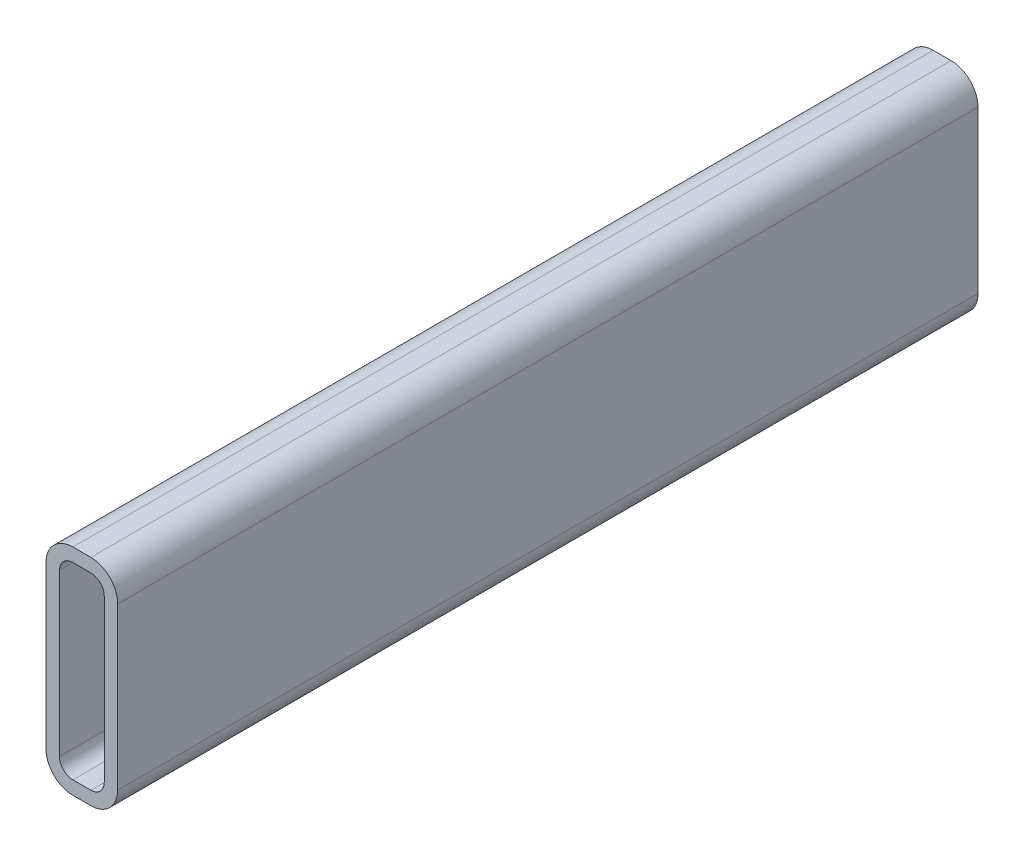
ISO-10303-21;
HEADER;
FILE_DESCRIPTION(('STEP AP214'),'2;1');
FILE_NAME('part.step','',(''),(''),'','','');
FILE_SCHEMA(('AUTOMOTIVE_DESIGN { 1 0 10303 214 1 1 1 1 }'));
ENDSEC;
DATA;
#1=APPLICATION_CONTEXT('core data for automotive mechanical design processes');
#2=APPLICATION_PROTOCOL_DEFINITION('international standard','automotive_design',2000,#1);
#3=PRODUCT_CONTEXT('',#1,'mechanical');
#4=PRODUCT('Part','Part','',(#3));
#5=PRODUCT_RELATED_PRODUCT_CATEGORY('part','',(#4));
#6=PRODUCT_DEFINITION_FORMATION('','',#4);
#7=PRODUCT_DEFINITION_CONTEXT('part definition',#1,'design');
#8=PRODUCT_DEFINITION('design','',#6,#7);
#9=PRODUCT_DEFINITION_SHAPE('','',#8);
#10=(LENGTH_UNIT() NAMED_UNIT(*) SI_UNIT(.MILLI.,.METRE.));
#11=(NAMED_UNIT(*) PLANE_ANGLE_UNIT() SI_UNIT($,.RADIAN.));
#12=(NAMED_UNIT(*) SI_UNIT($,.STERADIAN.) SOLID_ANGLE_UNIT());
#13=UNCERTAINTY_MEASURE_WITH_UNIT(LENGTH_MEASURE(1.E-05),#10,'distance_accuracy_value','');
#14=(GEOMETRIC_REPRESENTATION_CONTEXT(3) GLOBAL_UNCERTAINTY_ASSIGNED_CONTEXT((#13)) GLOBAL_UNIT_ASSIGNED_CONTEXT((#10,
#11,#12)) REPRESENTATION_CONTEXT('',''));
#15=CARTESIAN_POINT('',(0.,0.,0.));
#16=DIRECTION('',(0.,0.,1.));
#17=DIRECTION('',(1.,0.,0.));
#18=AXIS2_PLACEMENT_3D('',#15,#16,#17);
#19=CARTESIAN_POINT('',(9.525,66.675,304.8));
#20=DIRECTION('',(0.,0.,1.));
#21=DIRECTION('',(1.,0.,0.));
#22=AXIS2_PLACEMENT_3D('',#19,#20,#21);
#23=PLANE('',#22);
#24=CARTESIAN_POINT('',(9.525,66.675,304.8));
#25=DIRECTION('',(0.,0.,1.));
#26=DIRECTION('',(1.,0.,0.));
#27=AXIS2_PLACEMENT_3D('',#24,#25,#26);
#28=CIRCLE('',#27,9.52500000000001);
#29=CARTESIAN_POINT('',(9.525,76.2,304.8));
#30=VERTEX_POINT('',#29);
#31=CARTESIAN_POINT('',(0.,66.675,304.8));
#32=VERTEX_POINT('',#31);
#33=EDGE_CURVE('E211',#30,#32,#28,.T.);
#34=ORIENTED_EDGE('',*,*,#33,.T.);
#35=DIRECTION('',(0.,-1.,0.));
#36=VECTOR('',#35,1.);
#37=CARTESIAN_POINT('',(0.,9.525,304.8));
#38=LINE('',#37,#36);
#39=CARTESIAN_POINT('',(0.,9.525,304.8));
#40=VERTEX_POINT('',#39);
#41=EDGE_CURVE('E214',#32,#40,#38,.T.);
#42=ORIENTED_EDGE('',*,*,#41,.T.);
#43=CARTESIAN_POINT('',(9.525,9.525,304.8));
#44=DIRECTION('',(0.,0.,1.));
#45=DIRECTION('',(1.,0.,0.));
#46=AXIS2_PLACEMENT_3D('',#43,#44,#45);
#47=CIRCLE('',#46,9.525);
#48=CARTESIAN_POINT('',(9.525,0.,304.8));
#49=VERTEX_POINT('',#48);
#50=EDGE_CURVE('E217',#40,#49,#47,.T.);
#51=ORIENTED_EDGE('',*,*,#50,.T.);
#52=DIRECTION('',(1.,0.,0.));
#53=VECTOR('',#52,1.);
#54=CARTESIAN_POINT('',(15.875,0.,304.8));
#55=LINE('',#54,#53);
#56=CARTESIAN_POINT('',(15.875,0.,304.8));
#57=VERTEX_POINT('',#56);
#58=EDGE_CURVE('E219',#49,#57,#55,.T.);
#59=ORIENTED_EDGE('',*,*,#58,.T.);
#60=CARTESIAN_POINT('',(15.875,9.525,304.8));
#61=DIRECTION('',(0.,0.,1.));
#62=DIRECTION('',(1.,0.,0.));
#63=AXIS2_PLACEMENT_3D('',#60,#61,#62);
#64=CIRCLE('',#63,9.525);
#65=CARTESIAN_POINT('',(25.4,9.525,304.8));
#66=VERTEX_POINT('',#65);
#67=EDGE_CURVE('E221',#57,#66,#64,.T.);
#68=ORIENTED_EDGE('',*,*,#67,.T.);
#69=DIRECTION('',(0.,1.,0.));
#70=VECTOR('',#69,1.);
#71=CARTESIAN_POINT('',(25.4,66.675,304.8));
#72=LINE('',#71,#70);
#73=CARTESIAN_POINT('',(25.4,66.675,304.8));
#74=VERTEX_POINT('',#73);
#75=EDGE_CURVE('E223',#66,#74,#72,.T.);
#76=ORIENTED_EDGE('',*,*,#75,.T.);
#77=CARTESIAN_POINT('',(15.875,66.675,304.8));
#78=DIRECTION('',(0.,0.,1.));
#79=DIRECTION('',(1.,0.,0.));
#80=AXIS2_PLACEMENT_3D('',#77,#78,#79);
#81=CIRCLE('',#80,9.52500000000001);
#82=CARTESIAN_POINT('',(15.875,76.2,304.8));
#83=VERTEX_POINT('',#82);
#84=EDGE_CURVE('E225',#74,#83,#81,.T.);
#85=ORIENTED_EDGE('',*,*,#84,.T.);
#86=DIRECTION('',(-1.,0.,0.));
#87=VECTOR('',#86,1.);
#88=CARTESIAN_POINT('',(9.525,76.2,304.8));
#89=LINE('',#88,#87);
#90=EDGE_CURVE('E227',#83,#30,#89,.T.);
#91=ORIENTED_EDGE('',*,*,#90,.T.);
#92=EDGE_LOOP('',(#34,#42,#51,#59,#68,#76,#85,#91));
#93=FACE_BOUND('',#92,.T.);
#94=DIRECTION('',(0.,-1.,0.));
#95=VECTOR('',#94,1.);
#96=CARTESIAN_POINT('',(4.7625,9.525,304.8));
#97=LINE('',#96,#95);
#98=CARTESIAN_POINT('',(4.7625,66.675,304.8));
#99=VERTEX_POINT('',#98);
#100=CARTESIAN_POINT('',(4.7625,9.525,304.8));
#101=VERTEX_POINT('',#100);
#102=EDGE_CURVE('E154',#99,#101,#97,.T.);
#103=ORIENTED_EDGE('',*,*,#102,.F.);
#104=CARTESIAN_POINT('',(9.525,66.675,304.8));
#105=DIRECTION('',(0.,0.,1.));
#106=DIRECTION('',(1.,0.,0.));
#107=AXIS2_PLACEMENT_3D('',#104,#105,#106);
#108=CIRCLE('',#107,4.7625);
#109=CARTESIAN_POINT('',(9.525,71.4375,304.8));
#110=VERTEX_POINT('',#109);
#111=EDGE_CURVE('E146',#110,#99,#108,.T.);
#112=ORIENTED_EDGE('',*,*,#111,.F.);
#113=DIRECTION('',(-1.,0.,0.));
#114=VECTOR('',#113,1.);
#115=CARTESIAN_POINT('',(9.525,71.4375,304.8));
#116=LINE('',#115,#114);
#117=CARTESIAN_POINT('',(15.875,71.4375,304.8));
#118=VERTEX_POINT('',#117);
#119=EDGE_CURVE('E179',#118,#110,#116,.T.);
#120=ORIENTED_EDGE('',*,*,#119,.F.);
#121=CARTESIAN_POINT('',(15.875,66.675,304.8));
#122=DIRECTION('',(0.,0.,1.));
#123=DIRECTION('',(1.,0.,0.));
#124=AXIS2_PLACEMENT_3D('',#121,#122,#123);
#125=CIRCLE('',#124,4.7625);
#126=CARTESIAN_POINT('',(20.6375,66.675,304.8));
#127=VERTEX_POINT('',#126);
#128=EDGE_CURVE('E177',#127,#118,#125,.T.);
#129=ORIENTED_EDGE('',*,*,#128,.F.);
#130=DIRECTION('',(0.,1.,0.));
#131=VECTOR('',#130,1.);
#132=CARTESIAN_POINT('',(20.6375,66.675,304.8));
#133=LINE('',#132,#131);
#134=CARTESIAN_POINT('',(20.6375,9.525,304.8));
#135=VERTEX_POINT('',#134);
#136=EDGE_CURVE('E175',#135,#127,#133,.T.);
#137=ORIENTED_EDGE('',*,*,#136,.F.);
#138=CARTESIAN_POINT('',(15.875,9.525,304.8));
#139=DIRECTION('',(0.,0.,1.));
#140=DIRECTION('',(1.,0.,0.));
#141=AXIS2_PLACEMENT_3D('',#138,#139,#140);
#142=CIRCLE('',#141,4.7625);
#143=CARTESIAN_POINT('',(15.875,4.7625,304.8));
#144=VERTEX_POINT('',#143);
#145=EDGE_CURVE('E173',#144,#135,#142,.T.);
#146=ORIENTED_EDGE('',*,*,#145,.F.);
#147=DIRECTION('',(1.,0.,0.));
#148=VECTOR('',#147,1.);
#149=CARTESIAN_POINT('',(15.875,4.7625,304.8));
#150=LINE('',#149,#148);
#151=CARTESIAN_POINT('',(9.525,4.7625,304.8));
#152=VERTEX_POINT('',#151);
#153=EDGE_CURVE('E169',#152,#144,#150,.T.);
#154=ORIENTED_EDGE('',*,*,#153,.F.);
#155=CARTESIAN_POINT('',(9.525,9.525,304.8));
#156=DIRECTION('',(0.,0.,1.));
#157=DIRECTION('',(1.,0.,0.));
#158=AXIS2_PLACEMENT_3D('',#155,#156,#157);
#159=CIRCLE('',#158,4.7625);
#160=EDGE_CURVE('E167',#101,#152,#159,.T.);
#161=ORIENTED_EDGE('',*,*,#160,.F.);
#162=EDGE_LOOP('',(#103,#112,#120,#129,#137,#146,#154,#161));
#163=FACE_BOUND('',#162,.T.);
#164=ADVANCED_FACE('F33',(#93,#163),#23,.T.);
#165=CARTESIAN_POINT('',(9.525,66.675,0.));
#166=DIRECTION('',(0.,0.,1.));
#167=DIRECTION('',(1.,0.,0.));
#168=AXIS2_PLACEMENT_3D('',#165,#166,#167);
#169=PLANE('',#168);
#170=CARTESIAN_POINT('',(9.525,66.675,0.));
#171=DIRECTION('',(0.,0.,1.));
#172=DIRECTION('',(1.,0.,0.));
#173=AXIS2_PLACEMENT_3D('',#170,#171,#172);
#174=CIRCLE('',#173,9.52500000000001);
#175=CARTESIAN_POINT('',(9.525,76.2,0.));
#176=VERTEX_POINT('',#175);
#177=CARTESIAN_POINT('',(0.,66.675,0.));
#178=VERTEX_POINT('',#177);
#179=EDGE_CURVE('E162',#176,#178,#174,.T.);
#180=ORIENTED_EDGE('',*,*,#179,.F.);
#181=DIRECTION('',(-1.,0.,0.));
#182=VECTOR('',#181,1.);
#183=CARTESIAN_POINT('',(9.525,76.2,0.));
#184=LINE('',#183,#182);
#185=CARTESIAN_POINT('',(15.875,76.2,0.));
#186=VERTEX_POINT('',#185);
#187=EDGE_CURVE('E215',#186,#176,#184,.T.);
#188=ORIENTED_EDGE('',*,*,#187,.F.);
#189=CARTESIAN_POINT('',(15.875,66.675,0.));
#190=DIRECTION('',(0.,0.,1.));
#191=DIRECTION('',(1.,0.,0.));
#192=AXIS2_PLACEMENT_3D('',#189,#190,#191);
#193=CIRCLE('',#192,9.52500000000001);
#194=CARTESIAN_POINT('',(25.4,66.675,0.));
#195=VERTEX_POINT('',#194);
#196=EDGE_CURVE('E242',#195,#186,#193,.T.);
#197=ORIENTED_EDGE('',*,*,#196,.F.);
#198=DIRECTION('',(0.,1.,0.));
#199=VECTOR('',#198,1.);
#200=CARTESIAN_POINT('',(25.4,66.675,0.));
#201=LINE('',#200,#199);
#202=CARTESIAN_POINT('',(25.4,9.525,0.));
#203=VERTEX_POINT('',#202);
#204=EDGE_CURVE('E240',#203,#195,#201,.T.);
#205=ORIENTED_EDGE('',*,*,#204,.F.);
#206=CARTESIAN_POINT('',(15.875,9.525,0.));
#207=DIRECTION('',(0.,0.,1.));
#208=DIRECTION('',(1.,0.,0.));
#209=AXIS2_PLACEMENT_3D('',#206,#207,#208);
#210=CIRCLE('',#209,9.525);
#211=CARTESIAN_POINT('',(15.875,0.,0.));
#212=VERTEX_POINT('',#211);
#213=EDGE_CURVE('E238',#212,#203,#210,.T.);
#214=ORIENTED_EDGE('',*,*,#213,.F.);
#215=DIRECTION('',(1.,0.,0.));
#216=VECTOR('',#215,1.);
#217=CARTESIAN_POINT('',(15.875,0.,0.));
#218=LINE('',#217,#216);
#219=CARTESIAN_POINT('',(9.525,0.,0.));
#220=VERTEX_POINT('',#219);
#221=EDGE_CURVE('E236',#220,#212,#218,.T.);
#222=ORIENTED_EDGE('',*,*,#221,.F.);
#223=CARTESIAN_POINT('',(9.525,9.525,0.));
#224=DIRECTION('',(0.,0.,1.));
#225=DIRECTION('',(1.,0.,0.));
#226=AXIS2_PLACEMENT_3D('',#223,#224,#225);
#227=CIRCLE('',#226,9.525);
#228=CARTESIAN_POINT('',(0.,9.525,0.));
#229=VERTEX_POINT('',#228);
#230=EDGE_CURVE('E234',#229,#220,#227,.T.);
#231=ORIENTED_EDGE('',*,*,#230,.F.);
#232=DIRECTION('',(0.,-1.,0.));
#233=VECTOR('',#232,1.);
#234=CARTESIAN_POINT('',(0.,9.525,0.));
#235=LINE('',#234,#233);
#236=EDGE_CURVE('E232',#178,#229,#235,.T.);
#237=ORIENTED_EDGE('',*,*,#236,.F.);
#238=EDGE_LOOP('',(#180,#188,#197,#205,#214,#222,#231,#237));
#239=FACE_BOUND('',#238,.T.);
#240=CARTESIAN_POINT('',(9.525,66.675,0.));
#241=DIRECTION('',(0.,0.,1.));
#242=DIRECTION('',(1.,0.,0.));
#243=AXIS2_PLACEMENT_3D('',#240,#241,#242);
#244=CIRCLE('',#243,4.7625);
#245=CARTESIAN_POINT('',(9.525,71.4375,0.));
#246=VERTEX_POINT('',#245);
#247=CARTESIAN_POINT('',(4.7625,66.675,0.));
#248=VERTEX_POINT('',#247);
#249=EDGE_CURVE('E56',#246,#248,#244,.T.);
#250=ORIENTED_EDGE('',*,*,#249,.T.);
#251=DIRECTION('',(0.,-1.,0.));
#252=VECTOR('',#251,1.);
#253=CARTESIAN_POINT('',(4.7625,9.525,0.));
#254=LINE('',#253,#252);
#255=CARTESIAN_POINT('',(4.7625,9.525,0.));
#256=VERTEX_POINT('',#255);
#257=EDGE_CURVE('E161',#248,#256,#254,.T.);
#258=ORIENTED_EDGE('',*,*,#257,.T.);
#259=CARTESIAN_POINT('',(9.525,9.525,0.));
#260=DIRECTION('',(0.,0.,1.));
#261=DIRECTION('',(1.,0.,0.));
#262=AXIS2_PLACEMENT_3D('',#259,#260,#261);
#263=CIRCLE('',#262,4.7625);
#264=CARTESIAN_POINT('',(9.525,4.7625,0.));
#265=VERTEX_POINT('',#264);
#266=EDGE_CURVE('E183',#256,#265,#263,.T.);
#267=ORIENTED_EDGE('',*,*,#266,.T.);
#268=DIRECTION('',(1.,0.,0.));
#269=VECTOR('',#268,1.);
#270=CARTESIAN_POINT('',(15.875,4.7625,0.));
#271=LINE('',#270,#269);
#272=CARTESIAN_POINT('',(15.875,4.7625,0.));
#273=VERTEX_POINT('',#272);
#274=EDGE_CURVE('E186',#265,#273,#271,.T.);
#275=ORIENTED_EDGE('',*,*,#274,.T.);
#276=CARTESIAN_POINT('',(15.875,9.525,0.));
#277=DIRECTION('',(0.,0.,1.));
#278=DIRECTION('',(1.,0.,0.));
#279=AXIS2_PLACEMENT_3D('',#276,#277,#278);
#280=CIRCLE('',#279,4.7625);
#281=CARTESIAN_POINT('',(20.6375,9.525,0.));
#282=VERTEX_POINT('',#281);
#283=EDGE_CURVE('E189',#273,#282,#280,.T.);
#284=ORIENTED_EDGE('',*,*,#283,.T.);
#285=DIRECTION('',(0.,1.,0.));
#286=VECTOR('',#285,1.);
#287=CARTESIAN_POINT('',(20.6375,66.675,0.));
#288=LINE('',#287,#286);
#289=CARTESIAN_POINT('',(20.6375,66.675,0.));
#290=VERTEX_POINT('',#289);
#291=EDGE_CURVE('E192',#282,#290,#288,.T.);
#292=ORIENTED_EDGE('',*,*,#291,.T.);
#293=CARTESIAN_POINT('',(15.875,66.675,0.));
#294=DIRECTION('',(0.,0.,1.));
#295=DIRECTION('',(1.,0.,0.));
#296=AXIS2_PLACEMENT_3D('',#293,#294,#295);
#297=CIRCLE('',#296,4.7625);
#298=CARTESIAN_POINT('',(15.875,71.4375,0.));
#299=VERTEX_POINT('',#298);
#300=EDGE_CURVE('E195',#290,#299,#297,.T.);
#301=ORIENTED_EDGE('',*,*,#300,.T.);
#302=DIRECTION('',(-1.,0.,0.));
#303=VECTOR('',#302,1.);
#304=CARTESIAN_POINT('',(9.525,71.4375,0.));
#305=LINE('',#304,#303);
#306=EDGE_CURVE('E155',#299,#246,#305,.T.);
#307=ORIENTED_EDGE('',*,*,#306,.T.);
#308=EDGE_LOOP('',(#250,#258,#267,#275,#284,#292,#301,#307));
#309=FACE_BOUND('',#308,.T.);
#310=ADVANCED_FACE('F272',(#239,#309),#169,.F.);
#311=CARTESIAN_POINT('',(9.525,66.675,304.8));
#312=DIRECTION('',(0.,0.,-1.));
#313=DIRECTION('',(-1.,0.,0.));
#314=AXIS2_PLACEMENT_3D('',#311,#312,#313);
#315=CYLINDRICAL_SURFACE('',#314,9.52500000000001);
#316=ORIENTED_EDGE('',*,*,#179,.T.);
#317=DIRECTION('',(0.,0.,-1.));
#318=VECTOR('',#317,1.);
#319=CARTESIAN_POINT('',(0.,66.675,304.8));
#320=LINE('',#319,#318);
#321=EDGE_CURVE('E11',#32,#178,#320,.T.);
#322=ORIENTED_EDGE('',*,*,#321,.F.);
#323=ORIENTED_EDGE('',*,*,#33,.F.);
#324=DIRECTION('',(0.,0.,-1.));
#325=VECTOR('',#324,1.);
#326=CARTESIAN_POINT('',(9.525,76.2,304.8));
#327=LINE('',#326,#325);
#328=EDGE_CURVE('E229',#30,#176,#327,.T.);
#329=ORIENTED_EDGE('',*,*,#328,.T.);
#330=EDGE_LOOP('',(#316,#322,#323,#329));
#331=FACE_BOUND('',#330,.T.);
#332=ADVANCED_FACE('F35',(#331),#315,.T.);
#333=CARTESIAN_POINT('',(0.,9.525,304.8));
#334=DIRECTION('',(1.,0.,0.));
#335=DIRECTION('',(0.,0.,-1.));
#336=AXIS2_PLACEMENT_3D('',#333,#334,#335);
#337=PLANE('',#336);
#338=ORIENTED_EDGE('',*,*,#236,.T.);
#339=DIRECTION('',(0.,0.,-1.));
#340=VECTOR('',#339,1.);
#341=CARTESIAN_POINT('',(0.,9.525,304.8));
#342=LINE('',#341,#340);
#343=EDGE_CURVE('E41',#40,#229,#342,.T.);
#344=ORIENTED_EDGE('',*,*,#343,.F.);
#345=ORIENTED_EDGE('',*,*,#41,.F.);
#346=ORIENTED_EDGE('',*,*,#321,.T.);
#347=EDGE_LOOP('',(#338,#344,#345,#346));
#348=FACE_BOUND('',#347,.T.);
#349=ADVANCED_FACE('F289',(#348),#337,.F.);
#350=CARTESIAN_POINT('',(9.525,9.525,304.8));
#351=DIRECTION('',(0.,0.,-1.));
#352=DIRECTION('',(-1.,0.,0.));
#353=AXIS2_PLACEMENT_3D('',#350,#351,#352);
#354=CYLINDRICAL_SURFACE('',#353,9.525);
#355=ORIENTED_EDGE('',*,*,#230,.T.);
#356=DIRECTION('',(0.,0.,-1.));
#357=VECTOR('',#356,1.);
#358=CARTESIAN_POINT('',(9.525,0.,304.8));
#359=LINE('',#358,#357);
#360=EDGE_CURVE('E259',#49,#220,#359,.T.);
#361=ORIENTED_EDGE('',*,*,#360,.F.);
#362=ORIENTED_EDGE('',*,*,#50,.F.);
#363=ORIENTED_EDGE('',*,*,#343,.T.);
#364=EDGE_LOOP('',(#355,#361,#362,#363));
#365=FACE_BOUND('',#364,.T.);
#366=ADVANCED_FACE('F266',(#365),#354,.T.);
#367=CARTESIAN_POINT('',(15.875,0.,304.8));
#368=DIRECTION('',(0.,1.,0.));
#369=DIRECTION('',(0.,0.,1.));
#370=AXIS2_PLACEMENT_3D('',#367,#368,#369);
#371=PLANE('',#370);
#372=ORIENTED_EDGE('',*,*,#221,.T.);
#373=DIRECTION('',(0.,0.,-1.));
#374=VECTOR('',#373,1.);
#375=CARTESIAN_POINT('',(15.875,0.,304.8));
#376=LINE('',#375,#374);
#377=EDGE_CURVE('E256',#57,#212,#376,.T.);
#378=ORIENTED_EDGE('',*,*,#377,.F.);
#379=ORIENTED_EDGE('',*,*,#58,.F.);
#380=ORIENTED_EDGE('',*,*,#360,.T.);
#381=EDGE_LOOP('',(#372,#378,#379,#380));
#382=FACE_BOUND('',#381,.T.);
#383=ADVANCED_FACE('F278',(#382),#371,.F.);
#384=CARTESIAN_POINT('',(15.875,9.525,304.8));
#385=DIRECTION('',(0.,0.,-1.));
#386=DIRECTION('',(-1.,0.,0.));
#387=AXIS2_PLACEMENT_3D('',#384,#385,#386);
#388=CYLINDRICAL_SURFACE('',#387,9.525);
#389=ORIENTED_EDGE('',*,*,#213,.T.);
#390=DIRECTION('',(0.,0.,-1.));
#391=VECTOR('',#390,1.);
#392=CARTESIAN_POINT('',(25.4,9.525,304.8));
#393=LINE('',#392,#391);
#394=EDGE_CURVE('E253',#66,#203,#393,.T.);
#395=ORIENTED_EDGE('',*,*,#394,.F.);
#396=ORIENTED_EDGE('',*,*,#67,.F.);
#397=ORIENTED_EDGE('',*,*,#377,.T.);
#398=EDGE_LOOP('',(#389,#395,#396,#397));
#399=FACE_BOUND('',#398,.T.);
#400=ADVANCED_FACE('F282',(#399),#388,.T.);
#401=CARTESIAN_POINT('',(25.4,66.675,304.8));
#402=DIRECTION('',(-1.,0.,0.));
#403=DIRECTION('',(0.,0.,1.));
#404=AXIS2_PLACEMENT_3D('',#401,#402,#403);
#405=PLANE('',#404);
#406=ORIENTED_EDGE('',*,*,#204,.T.);
#407=DIRECTION('',(0.,0.,-1.));
#408=VECTOR('',#407,1.);
#409=CARTESIAN_POINT('',(25.4,66.675,304.8));
#410=LINE('',#409,#408);
#411=EDGE_CURVE('E250',#74,#195,#410,.T.);
#412=ORIENTED_EDGE('',*,*,#411,.F.);
#413=ORIENTED_EDGE('',*,*,#75,.F.);
#414=ORIENTED_EDGE('',*,*,#394,.T.);
#415=EDGE_LOOP('',(#406,#412,#413,#414));
#416=FACE_BOUND('',#415,.T.);
#417=ADVANCED_FACE('F302',(#416),#405,.F.);
#418=CARTESIAN_POINT('',(15.875,66.675,304.8));
#419=DIRECTION('',(0.,0.,-1.));
#420=DIRECTION('',(-1.,0.,0.));
#421=AXIS2_PLACEMENT_3D('',#418,#419,#420);
#422=CYLINDRICAL_SURFACE('',#421,9.52500000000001);
#423=ORIENTED_EDGE('',*,*,#196,.T.);
#424=DIRECTION('',(0.,0.,-1.));
#425=VECTOR('',#424,1.);
#426=CARTESIAN_POINT('',(15.875,76.2,304.8));
#427=LINE('',#426,#425);
#428=EDGE_CURVE('E247',#83,#186,#427,.T.);
#429=ORIENTED_EDGE('',*,*,#428,.F.);
#430=ORIENTED_EDGE('',*,*,#84,.F.);
#431=ORIENTED_EDGE('',*,*,#411,.T.);
#432=EDGE_LOOP('',(#423,#429,#430,#431));
#433=FACE_BOUND('',#432,.T.);
#434=ADVANCED_FACE('F300',(#433),#422,.T.);
#435=CARTESIAN_POINT('',(9.525,76.2,304.8));
#436=DIRECTION('',(0.,-1.,0.));
#437=DIRECTION('',(0.,0.,-1.));
#438=AXIS2_PLACEMENT_3D('',#435,#436,#437);
#439=PLANE('',#438);
#440=ORIENTED_EDGE('',*,*,#187,.T.);
#441=ORIENTED_EDGE('',*,*,#328,.F.);
#442=ORIENTED_EDGE('',*,*,#90,.F.);
#443=ORIENTED_EDGE('',*,*,#428,.T.);
#444=EDGE_LOOP('',(#440,#441,#442,#443));
#445=FACE_BOUND('',#444,.T.);
#446=ADVANCED_FACE('F295',(#445),#439,.F.);
#447=CARTESIAN_POINT('',(9.525,66.675,304.8));
#448=DIRECTION('',(0.,0.,-1.));
#449=DIRECTION('',(-1.,0.,0.));
#450=AXIS2_PLACEMENT_3D('',#447,#448,#449);
#451=CYLINDRICAL_SURFACE('',#450,4.7625);
#452=ORIENTED_EDGE('',*,*,#249,.F.);
#453=DIRECTION('',(0.,0.,-1.));
#454=VECTOR('',#453,1.);
#455=CARTESIAN_POINT('',(9.525,71.4375,304.8));
#456=LINE('',#455,#454);
#457=EDGE_CURVE('E150',#110,#246,#456,.T.);
#458=ORIENTED_EDGE('',*,*,#457,.F.);
#459=ORIENTED_EDGE('',*,*,#111,.T.);
#460=DIRECTION('',(0.,0.,-1.));
#461=VECTOR('',#460,1.);
#462=CARTESIAN_POINT('',(4.7625,66.675,304.8));
#463=LINE('',#462,#461);
#464=EDGE_CURVE('E149',#99,#248,#463,.T.);
#465=ORIENTED_EDGE('',*,*,#464,.T.);
#466=EDGE_LOOP('',(#452,#458,#459,#465));
#467=FACE_BOUND('',#466,.T.);
#468=ADVANCED_FACE('F148',(#467),#451,.F.);
#469=CARTESIAN_POINT('',(4.7625,9.525,304.8));
#470=DIRECTION('',(1.,0.,0.));
#471=DIRECTION('',(0.,0.,-1.));
#472=AXIS2_PLACEMENT_3D('',#469,#470,#471);
#473=PLANE('',#472);
#474=ORIENTED_EDGE('',*,*,#257,.F.);
#475=ORIENTED_EDGE('',*,*,#464,.F.);
#476=ORIENTED_EDGE('',*,*,#102,.T.);
#477=DIRECTION('',(0.,0.,-1.));
#478=VECTOR('',#477,1.);
#479=CARTESIAN_POINT('',(4.7625,9.525,304.8));
#480=LINE('',#479,#478);
#481=EDGE_CURVE('E163',#101,#256,#480,.T.);
#482=ORIENTED_EDGE('',*,*,#481,.T.);
#483=EDGE_LOOP('',(#474,#475,#476,#482));
#484=FACE_BOUND('',#483,.T.);
#485=ADVANCED_FACE('F158',(#484),#473,.T.);
#486=CARTESIAN_POINT('',(9.525,9.525,304.8));
#487=DIRECTION('',(0.,0.,-1.));
#488=DIRECTION('',(-1.,0.,0.));
#489=AXIS2_PLACEMENT_3D('',#486,#487,#488);
#490=CYLINDRICAL_SURFACE('',#489,4.7625);
#491=ORIENTED_EDGE('',*,*,#266,.F.);
#492=ORIENTED_EDGE('',*,*,#481,.F.);
#493=ORIENTED_EDGE('',*,*,#160,.T.);
#494=DIRECTION('',(0.,0.,-1.));
#495=VECTOR('',#494,1.);
#496=CARTESIAN_POINT('',(9.525,4.7625,304.8));
#497=LINE('',#496,#495);
#498=EDGE_CURVE('E208',#152,#265,#497,.T.);
#499=ORIENTED_EDGE('',*,*,#498,.T.);
#500=EDGE_LOOP('',(#491,#492,#493,#499));
#501=FACE_BOUND('',#500,.T.);
#502=ADVANCED_FACE('F327',(#501),#490,.F.);
#503=CARTESIAN_POINT('',(15.875,4.7625,304.8));
#504=DIRECTION('',(0.,1.,0.));
#505=DIRECTION('',(0.,0.,1.));
#506=AXIS2_PLACEMENT_3D('',#503,#504,#505);
#507=PLANE('',#506);
#508=ORIENTED_EDGE('',*,*,#274,.F.);
#509=ORIENTED_EDGE('',*,*,#498,.F.);
#510=ORIENTED_EDGE('',*,*,#153,.T.);
#511=DIRECTION('',(0.,0.,-1.));
#512=VECTOR('',#511,1.);
#513=CARTESIAN_POINT('',(15.875,4.7625,304.8));
#514=LINE('',#513,#512);
#515=EDGE_CURVE('E206',#144,#273,#514,.T.);
#516=ORIENTED_EDGE('',*,*,#515,.T.);
#517=EDGE_LOOP('',(#508,#509,#510,#516));
#518=FACE_BOUND('',#517,.T.);
#519=ADVANCED_FACE('F331',(#518),#507,.T.);
#520=CARTESIAN_POINT('',(15.875,9.525,304.8));
#521=DIRECTION('',(0.,0.,-1.));
#522=DIRECTION('',(-1.,0.,0.));
#523=AXIS2_PLACEMENT_3D('',#520,#521,#522);
#524=CYLINDRICAL_SURFACE('',#523,4.7625);
#525=ORIENTED_EDGE('',*,*,#283,.F.);
#526=ORIENTED_EDGE('',*,*,#515,.F.);
#527=ORIENTED_EDGE('',*,*,#145,.T.);
#528=DIRECTION('',(0.,0.,-1.));
#529=VECTOR('',#528,1.);
#530=CARTESIAN_POINT('',(20.6375,9.525,304.8));
#531=LINE('',#530,#529);
#532=EDGE_CURVE('E204',#135,#282,#531,.T.);
#533=ORIENTED_EDGE('',*,*,#532,.T.);
#534=EDGE_LOOP('',(#525,#526,#527,#533));
#535=FACE_BOUND('',#534,.T.);
#536=ADVANCED_FACE('F337',(#535),#524,.F.);
#537=CARTESIAN_POINT('',(20.6375,66.675,304.8));
#538=DIRECTION('',(-1.,0.,0.));
#539=DIRECTION('',(0.,0.,1.));
#540=AXIS2_PLACEMENT_3D('',#537,#538,#539);
#541=PLANE('',#540);
#542=ORIENTED_EDGE('',*,*,#291,.F.);
#543=ORIENTED_EDGE('',*,*,#532,.F.);
#544=ORIENTED_EDGE('',*,*,#136,.T.);
#545=DIRECTION('',(0.,0.,-1.));
#546=VECTOR('',#545,1.);
#547=CARTESIAN_POINT('',(20.6375,66.675,304.8));
#548=LINE('',#547,#546);
#549=EDGE_CURVE('E202',#127,#290,#548,.T.);
#550=ORIENTED_EDGE('',*,*,#549,.T.);
#551=EDGE_LOOP('',(#542,#543,#544,#550));
#552=FACE_BOUND('',#551,.T.);
#553=ADVANCED_FACE('F341',(#552),#541,.T.);
#554=CARTESIAN_POINT('',(15.875,66.675,304.8));
#555=DIRECTION('',(0.,0.,-1.));
#556=DIRECTION('',(-1.,0.,0.));
#557=AXIS2_PLACEMENT_3D('',#554,#555,#556);
#558=CYLINDRICAL_SURFACE('',#557,4.7625);
#559=ORIENTED_EDGE('',*,*,#300,.F.);
#560=ORIENTED_EDGE('',*,*,#549,.F.);
#561=ORIENTED_EDGE('',*,*,#128,.T.);
#562=DIRECTION('',(0.,0.,-1.));
#563=VECTOR('',#562,1.);
#564=CARTESIAN_POINT('',(15.875,71.4375,304.8));
#565=LINE('',#564,#563);
#566=EDGE_CURVE('E48',#118,#299,#565,.T.);
#567=ORIENTED_EDGE('',*,*,#566,.T.);
#568=EDGE_LOOP('',(#559,#560,#561,#567));
#569=FACE_BOUND('',#568,.T.);
#570=ADVANCED_FACE('F345',(#569),#558,.F.);
#571=CARTESIAN_POINT('',(9.525,71.4375,304.8));
#572=DIRECTION('',(0.,-1.,0.));
#573=DIRECTION('',(0.,0.,-1.));
#574=AXIS2_PLACEMENT_3D('',#571,#572,#573);
#575=PLANE('',#574);
#576=ORIENTED_EDGE('',*,*,#306,.F.);
#577=ORIENTED_EDGE('',*,*,#566,.F.);
#578=ORIENTED_EDGE('',*,*,#119,.T.);
#579=ORIENTED_EDGE('',*,*,#457,.T.);
#580=EDGE_LOOP('',(#576,#577,#578,#579));
#581=FACE_BOUND('',#580,.T.);
#582=ADVANCED_FACE('F349',(#581),#575,.T.);
#583=CLOSED_SHELL('',(#164,#310,#332,#349,#366,#383,#400,#417,#434,#446,#468,#485,#502,#519,
#536,#553,#570,#582));
#584=MANIFOLD_SOLID_BREP('B2',#583);
#585=ADVANCED_BREP_SHAPE_REPRESENTATION('',(#18,#584),#14);
#586=SHAPE_DEFINITION_REPRESENTATION(#9,#585);
ENDSEC;
END-ISO-10303-21;
